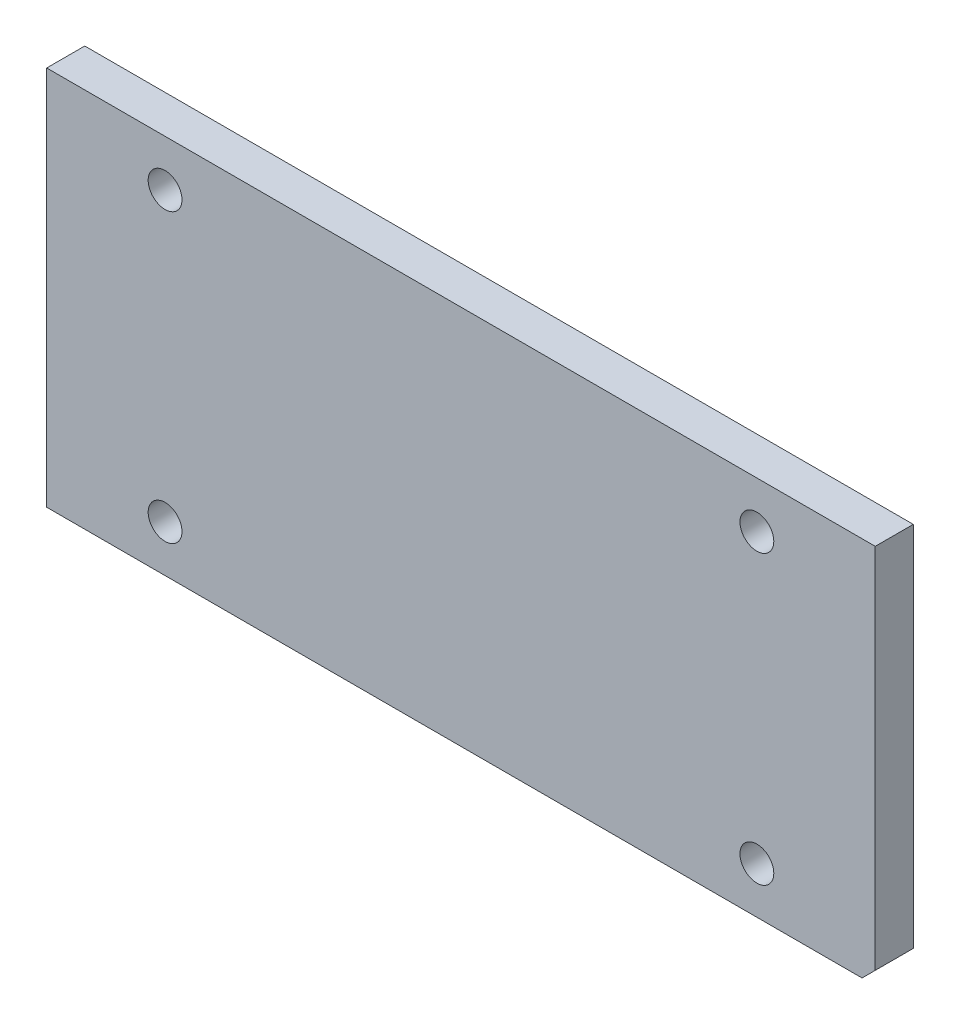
ISO-10303-21;
HEADER;
FILE_DESCRIPTION(('STEP AP214'),'2;1');
FILE_NAME('part.step','',(''),(''),'','','');
FILE_SCHEMA(('AUTOMOTIVE_DESIGN { 1 0 10303 214 1 1 1 1 }'));
ENDSEC;
DATA;
#1=APPLICATION_CONTEXT('core data for automotive mechanical design processes');
#2=APPLICATION_PROTOCOL_DEFINITION('international standard','automotive_design',2000,#1);
#3=PRODUCT_CONTEXT('',#1,'mechanical');
#4=PRODUCT('Part','Part','',(#3));
#5=PRODUCT_RELATED_PRODUCT_CATEGORY('part','',(#4));
#6=PRODUCT_DEFINITION_FORMATION('','',#4);
#7=PRODUCT_DEFINITION_CONTEXT('part definition',#1,'design');
#8=PRODUCT_DEFINITION('design','',#6,#7);
#9=PRODUCT_DEFINITION_SHAPE('','',#8);
#10=(LENGTH_UNIT() NAMED_UNIT(*) SI_UNIT(.MILLI.,.METRE.));
#11=(NAMED_UNIT(*) PLANE_ANGLE_UNIT() SI_UNIT($,.RADIAN.));
#12=(NAMED_UNIT(*) SI_UNIT($,.STERADIAN.) SOLID_ANGLE_UNIT());
#13=UNCERTAINTY_MEASURE_WITH_UNIT(LENGTH_MEASURE(1.E-05),#10,'distance_accuracy_value','');
#14=(GEOMETRIC_REPRESENTATION_CONTEXT(3) GLOBAL_UNCERTAINTY_ASSIGNED_CONTEXT((#13)) GLOBAL_UNIT_ASSIGNED_CONTEXT((#10,
#11,#12)) REPRESENTATION_CONTEXT('',''));
#15=CARTESIAN_POINT('',(0.,0.,0.));
#16=DIRECTION('',(0.,0.,1.));
#17=DIRECTION('',(1.,0.,0.));
#18=AXIS2_PLACEMENT_3D('',#15,#16,#17);
#19=CARTESIAN_POINT('',(-98.,-45.,-224.675682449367));
#20=DIRECTION('',(-1.,0.,0.));
#21=DIRECTION('',(0.,0.,1.));
#22=AXIS2_PLACEMENT_3D('',#19,#20,#21);
#23=PLANE('',#22);
#24=DIRECTION('',(0.,1.,0.));
#25=VECTOR('',#24,1.);
#26=CARTESIAN_POINT('',(-98.,-45.,-9.00000000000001));
#27=LINE('',#26,#25);
#28=CARTESIAN_POINT('',(-98.,-45.,-9.00000000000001));
#29=VERTEX_POINT('',#28);
#30=CARTESIAN_POINT('',(-98.,45.,-9.00000000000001));
#31=VERTEX_POINT('',#30);
#32=EDGE_CURVE('E87',#29,#31,#27,.T.);
#33=ORIENTED_EDGE('',*,*,#32,.F.);
#34=DIRECTION('',(0.,0.,1.));
#35=VECTOR('',#34,1.);
#36=CARTESIAN_POINT('',(-98.,-45.,-224.675682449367));
#37=LINE('',#36,#35);
#38=CARTESIAN_POINT('',(-98.,-45.,0.));
#39=VERTEX_POINT('',#38);
#40=EDGE_CURVE('E81',#29,#39,#37,.T.);
#41=ORIENTED_EDGE('',*,*,#40,.T.);
#42=DIRECTION('',(0.,-1.,0.));
#43=VECTOR('',#42,1.);
#44=CARTESIAN_POINT('',(-98.,-45.,0.));
#45=LINE('',#44,#43);
#46=CARTESIAN_POINT('',(-98.,45.,0.));
#47=VERTEX_POINT('',#46);
#48=EDGE_CURVE('E85',#47,#39,#45,.T.);
#49=ORIENTED_EDGE('',*,*,#48,.F.);
#50=DIRECTION('',(0.,0.,1.));
#51=VECTOR('',#50,1.);
#52=CARTESIAN_POINT('',(-98.,45.,-224.675682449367));
#53=LINE('',#52,#51);
#54=EDGE_CURVE('E112',#31,#47,#53,.T.);
#55=ORIENTED_EDGE('',*,*,#54,.F.);
#56=EDGE_LOOP('',(#33,#41,#49,#55));
#57=FACE_BOUND('',#56,.T.);
#58=ADVANCED_FACE('F34',(#57),#23,.T.);
#59=CARTESIAN_POINT('',(-98.,45.,-224.675682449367));
#60=DIRECTION('',(0.,1.,0.));
#61=DIRECTION('',(-1.,0.,0.));
#62=AXIS2_PLACEMENT_3D('',#59,#60,#61);
#63=PLANE('',#62);
#64=DIRECTION('',(1.,0.,0.));
#65=VECTOR('',#64,1.);
#66=CARTESIAN_POINT('',(-98.,45.,-9.00000000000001));
#67=LINE('',#66,#65);
#68=CARTESIAN_POINT('',(98.,45.,-9.00000000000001));
#69=VERTEX_POINT('',#68);
#70=EDGE_CURVE('E168',#31,#69,#67,.T.);
#71=ORIENTED_EDGE('',*,*,#70,.F.);
#72=ORIENTED_EDGE('',*,*,#54,.T.);
#73=DIRECTION('',(-1.,0.,0.));
#74=VECTOR('',#73,1.);
#75=CARTESIAN_POINT('',(-98.,45.,0.));
#76=LINE('',#75,#74);
#77=CARTESIAN_POINT('',(98.,45.,0.));
#78=VERTEX_POINT('',#77);
#79=EDGE_CURVE('E91',#78,#47,#76,.T.);
#80=ORIENTED_EDGE('',*,*,#79,.F.);
#81=DIRECTION('',(0.,0.,1.));
#82=VECTOR('',#81,1.);
#83=CARTESIAN_POINT('',(98.,45.,-224.675682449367));
#84=LINE('',#83,#82);
#85=EDGE_CURVE('E90',#69,#78,#84,.T.);
#86=ORIENTED_EDGE('',*,*,#85,.F.);
#87=EDGE_LOOP('',(#71,#72,#80,#86));
#88=FACE_BOUND('',#87,.T.);
#89=ADVANCED_FACE('F174',(#88),#63,.T.);
#90=CARTESIAN_POINT('',(98.,-45.,-224.675682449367));
#91=DIRECTION('',(1.,0.,0.));
#92=DIRECTION('',(0.,1.,0.));
#93=AXIS2_PLACEMENT_3D('',#90,#91,#92);
#94=PLANE('',#93);
#95=DIRECTION('',(0.,1.,0.));
#96=VECTOR('',#95,1.);
#97=CARTESIAN_POINT('',(98.,-45.,0.));
#98=LINE('',#97,#96);
#99=CARTESIAN_POINT('',(98.,-41.88,0.));
#100=VERTEX_POINT('',#99);
#101=EDGE_CURVE('E98',#100,#78,#98,.T.);
#102=ORIENTED_EDGE('',*,*,#101,.F.);
#103=DIRECTION('',(0.,0.,-1.));
#104=VECTOR('',#103,1.);
#105=CARTESIAN_POINT('',(98.,-41.88,-224.675682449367));
#106=LINE('',#105,#104);
#107=CARTESIAN_POINT('',(98.,-41.88,-9.00000000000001));
#108=VERTEX_POINT('',#107);
#109=EDGE_CURVE('E42',#100,#108,#106,.T.);
#110=ORIENTED_EDGE('',*,*,#109,.T.);
#111=DIRECTION('',(0.,-1.,0.));
#112=VECTOR('',#111,1.);
#113=CARTESIAN_POINT('',(98.,-45.,-9.00000000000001));
#114=LINE('',#113,#112);
#115=EDGE_CURVE('E114',#69,#108,#114,.T.);
#116=ORIENTED_EDGE('',*,*,#115,.F.);
#117=ORIENTED_EDGE('',*,*,#85,.T.);
#118=EDGE_LOOP('',(#102,#110,#116,#117));
#119=FACE_BOUND('',#118,.T.);
#120=ADVANCED_FACE('F175',(#119),#94,.T.);
#121=CARTESIAN_POINT('',(-98.,-45.,-224.675682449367));
#122=DIRECTION('',(0.,-1.,0.));
#123=DIRECTION('',(1.,0.,0.));
#124=AXIS2_PLACEMENT_3D('',#121,#122,#123);
#125=PLANE('',#124);
#126=DIRECTION('',(-1.,0.,0.));
#127=VECTOR('',#126,1.);
#128=CARTESIAN_POINT('',(-98.,-45.,-9.00000000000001));
#129=LINE('',#128,#127);
#130=CARTESIAN_POINT('',(94.88,-45.,-9.00000000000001));
#131=VERTEX_POINT('',#130);
#132=EDGE_CURVE('E117',#131,#29,#129,.T.);
#133=ORIENTED_EDGE('',*,*,#132,.F.);
#134=DIRECTION('',(0.,0.,1.));
#135=VECTOR('',#134,1.);
#136=CARTESIAN_POINT('',(94.88,-45.,-224.675682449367));
#137=LINE('',#136,#135);
#138=CARTESIAN_POINT('',(94.88,-45.,0.));
#139=VERTEX_POINT('',#138);
#140=EDGE_CURVE('E97',#131,#139,#137,.T.);
#141=ORIENTED_EDGE('',*,*,#140,.T.);
#142=DIRECTION('',(1.,0.,0.));
#143=VECTOR('',#142,1.);
#144=CARTESIAN_POINT('',(-98.,-45.,0.));
#145=LINE('',#144,#143);
#146=EDGE_CURVE('E94',#39,#139,#145,.T.);
#147=ORIENTED_EDGE('',*,*,#146,.F.);
#148=ORIENTED_EDGE('',*,*,#40,.F.);
#149=EDGE_LOOP('',(#133,#141,#147,#148));
#150=FACE_BOUND('',#149,.T.);
#151=ADVANCED_FACE('F95',(#150),#125,.T.);
#152=CARTESIAN_POINT('',(0.,0.,0.));
#153=DIRECTION('',(0.,0.,-1.));
#154=DIRECTION('',(-1.,0.,0.));
#155=AXIS2_PLACEMENT_3D('',#152,#153,#154);
#156=PLANE('',#155);
#157=CARTESIAN_POINT('',(70.0000000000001,-34.,0.));
#158=DIRECTION('',(0.,0.,1.));
#159=DIRECTION('',(1.,0.,0.));
#160=AXIS2_PLACEMENT_3D('',#157,#158,#159);
#161=CIRCLE('',#160,4.);
#162=CARTESIAN_POINT('',(74.0000000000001,-34.,0.));
#163=VERTEX_POINT('',#162);
#164=EDGE_CURVE('E146',#163,#163,#161,.T.);
#165=ORIENTED_EDGE('',*,*,#164,.F.);
#166=EDGE_LOOP('',(#165));
#167=FACE_BOUND('',#166,.T.);
#168=CARTESIAN_POINT('',(-70.,-34.,0.));
#169=DIRECTION('',(0.,0.,1.));
#170=DIRECTION('',(1.,0.,0.));
#171=AXIS2_PLACEMENT_3D('',#168,#169,#170);
#172=CIRCLE('',#171,4.);
#173=CARTESIAN_POINT('',(-65.9999999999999,-34.,0.));
#174=VERTEX_POINT('',#173);
#175=EDGE_CURVE('E132',#174,#174,#172,.T.);
#176=ORIENTED_EDGE('',*,*,#175,.F.);
#177=EDGE_LOOP('',(#176));
#178=FACE_BOUND('',#177,.T.);
#179=CARTESIAN_POINT('',(-70.,34.,0.));
#180=DIRECTION('',(0.,0.,1.));
#181=DIRECTION('',(1.,0.,0.));
#182=AXIS2_PLACEMENT_3D('',#179,#180,#181);
#183=CIRCLE('',#182,4.);
#184=CARTESIAN_POINT('',(-65.9999999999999,34.,0.));
#185=VERTEX_POINT('',#184);
#186=EDGE_CURVE('E127',#185,#185,#183,.T.);
#187=ORIENTED_EDGE('',*,*,#186,.F.);
#188=EDGE_LOOP('',(#187));
#189=FACE_BOUND('',#188,.T.);
#190=CARTESIAN_POINT('',(70.0000000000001,34.,0.));
#191=DIRECTION('',(0.,0.,1.));
#192=DIRECTION('',(1.,0.,0.));
#193=AXIS2_PLACEMENT_3D('',#190,#191,#192);
#194=CIRCLE('',#193,4.);
#195=CARTESIAN_POINT('',(74.0000000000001,34.,0.));
#196=VERTEX_POINT('',#195);
#197=EDGE_CURVE('E122',#196,#196,#194,.T.);
#198=ORIENTED_EDGE('',*,*,#197,.F.);
#199=EDGE_LOOP('',(#198));
#200=FACE_BOUND('',#199,.T.);
#201=ORIENTED_EDGE('',*,*,#146,.T.);
#202=DIRECTION('',(-0.707106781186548,-0.707106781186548,0.));
#203=VECTOR('',#202,1.);
#204=CARTESIAN_POINT('',(94.88,-45.,0.));
#205=LINE('',#204,#203);
#206=EDGE_CURVE('E56',#139,#100,#205,.F.);
#207=ORIENTED_EDGE('',*,*,#206,.T.);
#208=ORIENTED_EDGE('',*,*,#101,.T.);
#209=ORIENTED_EDGE('',*,*,#79,.T.);
#210=ORIENTED_EDGE('',*,*,#48,.T.);
#211=EDGE_LOOP('',(#201,#207,#208,#209,#210));
#212=FACE_BOUND('',#211,.T.);
#213=ADVANCED_FACE('F100',(#167,#178,#189,#200,#212),#156,.F.);
#214=CARTESIAN_POINT('',(0.,0.,-9.));
#215=DIRECTION('',(0.,0.,1.));
#216=DIRECTION('',(1.,0.,0.));
#217=AXIS2_PLACEMENT_3D('',#214,#215,#216);
#218=PLANE('',#217);
#219=CARTESIAN_POINT('',(70.0000000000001,-34.,-9.));
#220=DIRECTION('',(0.,0.,1.));
#221=DIRECTION('',(1.,0.,0.));
#222=AXIS2_PLACEMENT_3D('',#219,#220,#221);
#223=CIRCLE('',#222,3.4);
#224=CARTESIAN_POINT('',(73.4000000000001,-34.,-9.));
#225=VERTEX_POINT('',#224);
#226=EDGE_CURVE('E129',#225,#225,#223,.T.);
#227=ORIENTED_EDGE('',*,*,#226,.T.);
#228=EDGE_LOOP('',(#227));
#229=FACE_BOUND('',#228,.T.);
#230=CARTESIAN_POINT('',(-70.,-34.,-9.));
#231=DIRECTION('',(0.,0.,1.));
#232=DIRECTION('',(1.,0.,0.));
#233=AXIS2_PLACEMENT_3D('',#230,#231,#232);
#234=CIRCLE('',#233,3.4);
#235=CARTESIAN_POINT('',(-66.6,-34.,-9.));
#236=VERTEX_POINT('',#235);
#237=EDGE_CURVE('E124',#236,#236,#234,.T.);
#238=ORIENTED_EDGE('',*,*,#237,.T.);
#239=EDGE_LOOP('',(#238));
#240=FACE_BOUND('',#239,.T.);
#241=CARTESIAN_POINT('',(-70.,34.,-9.));
#242=DIRECTION('',(0.,0.,1.));
#243=DIRECTION('',(1.,0.,0.));
#244=AXIS2_PLACEMENT_3D('',#241,#242,#243);
#245=CIRCLE('',#244,3.4);
#246=CARTESIAN_POINT('',(-66.6,34.,-9.));
#247=VERTEX_POINT('',#246);
#248=EDGE_CURVE('E119',#247,#247,#245,.T.);
#249=ORIENTED_EDGE('',*,*,#248,.T.);
#250=EDGE_LOOP('',(#249));
#251=FACE_BOUND('',#250,.T.);
#252=CARTESIAN_POINT('',(70.0000000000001,34.,-9.));
#253=DIRECTION('',(0.,0.,1.));
#254=DIRECTION('',(1.,0.,0.));
#255=AXIS2_PLACEMENT_3D('',#252,#253,#254);
#256=CIRCLE('',#255,3.4);
#257=CARTESIAN_POINT('',(73.4000000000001,34.,-9.));
#258=VERTEX_POINT('',#257);
#259=EDGE_CURVE('E102',#258,#258,#256,.T.);
#260=ORIENTED_EDGE('',*,*,#259,.T.);
#261=EDGE_LOOP('',(#260));
#262=FACE_BOUND('',#261,.T.);
#263=ORIENTED_EDGE('',*,*,#115,.T.);
#264=DIRECTION('',(0.707106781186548,0.707106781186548,0.));
#265=VECTOR('',#264,1.);
#266=CARTESIAN_POINT('',(94.88,-45.,-9.00000000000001));
#267=LINE('',#266,#265);
#268=EDGE_CURVE('E11',#108,#131,#267,.F.);
#269=ORIENTED_EDGE('',*,*,#268,.T.);
#270=ORIENTED_EDGE('',*,*,#132,.T.);
#271=ORIENTED_EDGE('',*,*,#32,.T.);
#272=ORIENTED_EDGE('',*,*,#70,.T.);
#273=EDGE_LOOP('',(#263,#269,#270,#271,#272));
#274=FACE_BOUND('',#273,.T.);
#275=ADVANCED_FACE('F171',(#229,#240,#251,#262,#274),#218,.F.);
#276=CARTESIAN_POINT('',(70.0000000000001,34.,0.));
#277=DIRECTION('',(0.,0.,1.));
#278=DIRECTION('',(1.,0.,0.));
#279=AXIS2_PLACEMENT_3D('',#276,#277,#278);
#280=CYLINDRICAL_SURFACE('',#279,3.4);
#281=CARTESIAN_POINT('',(70.0000000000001,34.,-8.9));
#282=DIRECTION('',(0.,0.,1.));
#283=DIRECTION('',(1.,0.,0.));
#284=AXIS2_PLACEMENT_3D('',#281,#282,#283);
#285=CIRCLE('',#284,3.4);
#286=CARTESIAN_POINT('',(73.4000000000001,34.,-8.9));
#287=VERTEX_POINT('',#286);
#288=EDGE_CURVE('E105',#287,#287,#285,.T.);
#289=ORIENTED_EDGE('',*,*,#288,.T.);
#290=EDGE_LOOP('',(#289));
#291=FACE_BOUND('',#290,.T.);
#292=ORIENTED_EDGE('',*,*,#259,.F.);
#293=EDGE_LOOP('',(#292));
#294=FACE_BOUND('',#293,.T.);
#295=ADVANCED_FACE('F201',(#291,#294),#280,.F.);
#296=CARTESIAN_POINT('',(73.4000000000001,34.,-8.9));
#297=DIRECTION('',(0.,0.,-1.));
#298=DIRECTION('',(-1.,0.,0.));
#299=AXIS2_PLACEMENT_3D('',#296,#297,#298);
#300=PLANE('',#299);
#301=ORIENTED_EDGE('',*,*,#288,.F.);
#302=EDGE_LOOP('',(#301));
#303=FACE_BOUND('',#302,.T.);
#304=CARTESIAN_POINT('',(70.0000000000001,34.,-8.9));
#305=DIRECTION('',(0.,0.,1.));
#306=DIRECTION('',(1.,0.,0.));
#307=AXIS2_PLACEMENT_3D('',#304,#305,#306);
#308=CIRCLE('',#307,4.);
#309=CARTESIAN_POINT('',(74.0000000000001,34.,-8.9));
#310=VERTEX_POINT('',#309);
#311=EDGE_CURVE('E163',#310,#310,#308,.T.);
#312=ORIENTED_EDGE('',*,*,#311,.T.);
#313=EDGE_LOOP('',(#312));
#314=FACE_BOUND('',#313,.T.);
#315=ADVANCED_FACE('F204',(#303,#314),#300,.F.);
#316=CARTESIAN_POINT('',(70.0000000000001,34.,0.));
#317=DIRECTION('',(0.,0.,1.));
#318=DIRECTION('',(1.,0.,0.));
#319=AXIS2_PLACEMENT_3D('',#316,#317,#318);
#320=CYLINDRICAL_SURFACE('',#319,4.);
#321=ORIENTED_EDGE('',*,*,#311,.F.);
#322=EDGE_LOOP('',(#321));
#323=FACE_BOUND('',#322,.T.);
#324=ORIENTED_EDGE('',*,*,#197,.T.);
#325=EDGE_LOOP('',(#324));
#326=FACE_BOUND('',#325,.T.);
#327=ADVANCED_FACE('F208',(#323,#326),#320,.F.);
#328=CARTESIAN_POINT('',(-70.,34.,0.));
#329=DIRECTION('',(0.,0.,1.));
#330=DIRECTION('',(1.,0.,0.));
#331=AXIS2_PLACEMENT_3D('',#328,#329,#330);
#332=CYLINDRICAL_SURFACE('',#331,3.4);
#333=CARTESIAN_POINT('',(-70.,34.,-8.9));
#334=DIRECTION('',(0.,0.,1.));
#335=DIRECTION('',(1.,0.,0.));
#336=AXIS2_PLACEMENT_3D('',#333,#334,#335);
#337=CIRCLE('',#336,3.4);
#338=CARTESIAN_POINT('',(-66.6,34.,-8.9));
#339=VERTEX_POINT('',#338);
#340=EDGE_CURVE('E123',#339,#339,#337,.T.);
#341=ORIENTED_EDGE('',*,*,#340,.T.);
#342=EDGE_LOOP('',(#341));
#343=FACE_BOUND('',#342,.T.);
#344=ORIENTED_EDGE('',*,*,#248,.F.);
#345=EDGE_LOOP('',(#344));
#346=FACE_BOUND('',#345,.T.);
#347=ADVANCED_FACE('F212',(#343,#346),#332,.F.);
#348=CARTESIAN_POINT('',(-66.6,34.,-8.9));
#349=DIRECTION('',(0.,0.,-1.));
#350=DIRECTION('',(-1.,0.,0.));
#351=AXIS2_PLACEMENT_3D('',#348,#349,#350);
#352=PLANE('',#351);
#353=ORIENTED_EDGE('',*,*,#340,.F.);
#354=EDGE_LOOP('',(#353));
#355=FACE_BOUND('',#354,.T.);
#356=CARTESIAN_POINT('',(-70.,34.,-8.9));
#357=DIRECTION('',(0.,0.,1.));
#358=DIRECTION('',(1.,0.,0.));
#359=AXIS2_PLACEMENT_3D('',#356,#357,#358);
#360=CIRCLE('',#359,4.);
#361=CARTESIAN_POINT('',(-65.9999999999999,34.,-8.9));
#362=VERTEX_POINT('',#361);
#363=EDGE_CURVE('E156',#362,#362,#360,.T.);
#364=ORIENTED_EDGE('',*,*,#363,.T.);
#365=EDGE_LOOP('',(#364));
#366=FACE_BOUND('',#365,.T.);
#367=ADVANCED_FACE('F216',(#355,#366),#352,.F.);
#368=CARTESIAN_POINT('',(-70.,34.,0.));
#369=DIRECTION('',(0.,0.,1.));
#370=DIRECTION('',(1.,0.,0.));
#371=AXIS2_PLACEMENT_3D('',#368,#369,#370);
#372=CYLINDRICAL_SURFACE('',#371,4.);
#373=ORIENTED_EDGE('',*,*,#363,.F.);
#374=EDGE_LOOP('',(#373));
#375=FACE_BOUND('',#374,.T.);
#376=ORIENTED_EDGE('',*,*,#186,.T.);
#377=EDGE_LOOP('',(#376));
#378=FACE_BOUND('',#377,.T.);
#379=ADVANCED_FACE('F220',(#375,#378),#372,.F.);
#380=CARTESIAN_POINT('',(-70.,-34.,0.));
#381=DIRECTION('',(0.,0.,1.));
#382=DIRECTION('',(1.,0.,0.));
#383=AXIS2_PLACEMENT_3D('',#380,#381,#382);
#384=CYLINDRICAL_SURFACE('',#383,3.4);
#385=CARTESIAN_POINT('',(-70.,-34.,-8.9));
#386=DIRECTION('',(0.,0.,1.));
#387=DIRECTION('',(1.,0.,0.));
#388=AXIS2_PLACEMENT_3D('',#385,#386,#387);
#389=CIRCLE('',#388,3.4);
#390=CARTESIAN_POINT('',(-66.6,-34.,-8.9));
#391=VERTEX_POINT('',#390);
#392=EDGE_CURVE('E128',#391,#391,#389,.T.);
#393=ORIENTED_EDGE('',*,*,#392,.T.);
#394=EDGE_LOOP('',(#393));
#395=FACE_BOUND('',#394,.T.);
#396=ORIENTED_EDGE('',*,*,#237,.F.);
#397=EDGE_LOOP('',(#396));
#398=FACE_BOUND('',#397,.T.);
#399=ADVANCED_FACE('F224',(#395,#398),#384,.F.);
#400=CARTESIAN_POINT('',(-66.6,-34.,-8.9));
#401=DIRECTION('',(0.,0.,-1.));
#402=DIRECTION('',(-1.,0.,0.));
#403=AXIS2_PLACEMENT_3D('',#400,#401,#402);
#404=PLANE('',#403);
#405=ORIENTED_EDGE('',*,*,#392,.F.);
#406=EDGE_LOOP('',(#405));
#407=FACE_BOUND('',#406,.T.);
#408=CARTESIAN_POINT('',(-70.,-34.,-8.9));
#409=DIRECTION('',(0.,0.,1.));
#410=DIRECTION('',(1.,0.,0.));
#411=AXIS2_PLACEMENT_3D('',#408,#409,#410);
#412=CIRCLE('',#411,4.);
#413=CARTESIAN_POINT('',(-65.9999999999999,-34.,-8.9));
#414=VERTEX_POINT('',#413);
#415=EDGE_CURVE('E138',#414,#414,#412,.T.);
#416=ORIENTED_EDGE('',*,*,#415,.T.);
#417=EDGE_LOOP('',(#416));
#418=FACE_BOUND('',#417,.T.);
#419=ADVANCED_FACE('F228',(#407,#418),#404,.F.);
#420=CARTESIAN_POINT('',(-70.,-34.,0.));
#421=DIRECTION('',(0.,0.,1.));
#422=DIRECTION('',(1.,0.,0.));
#423=AXIS2_PLACEMENT_3D('',#420,#421,#422);
#424=CYLINDRICAL_SURFACE('',#423,4.);
#425=ORIENTED_EDGE('',*,*,#415,.F.);
#426=EDGE_LOOP('',(#425));
#427=FACE_BOUND('',#426,.T.);
#428=ORIENTED_EDGE('',*,*,#175,.T.);
#429=EDGE_LOOP('',(#428));
#430=FACE_BOUND('',#429,.T.);
#431=ADVANCED_FACE('F232',(#427,#430),#424,.F.);
#432=CARTESIAN_POINT('',(70.0000000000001,-34.,0.));
#433=DIRECTION('',(0.,0.,1.));
#434=DIRECTION('',(1.,0.,0.));
#435=AXIS2_PLACEMENT_3D('',#432,#433,#434);
#436=CYLINDRICAL_SURFACE('',#435,3.4);
#437=CARTESIAN_POINT('',(70.0000000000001,-34.,-8.9));
#438=DIRECTION('',(0.,0.,1.));
#439=DIRECTION('',(1.,0.,0.));
#440=AXIS2_PLACEMENT_3D('',#437,#438,#439);
#441=CIRCLE('',#440,3.4);
#442=CARTESIAN_POINT('',(73.4000000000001,-34.,-8.9));
#443=VERTEX_POINT('',#442);
#444=EDGE_CURVE('E133',#443,#443,#441,.T.);
#445=ORIENTED_EDGE('',*,*,#444,.T.);
#446=EDGE_LOOP('',(#445));
#447=FACE_BOUND('',#446,.T.);
#448=ORIENTED_EDGE('',*,*,#226,.F.);
#449=EDGE_LOOP('',(#448));
#450=FACE_BOUND('',#449,.T.);
#451=ADVANCED_FACE('F236',(#447,#450),#436,.F.);
#452=CARTESIAN_POINT('',(73.4000000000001,-34.,-8.9));
#453=DIRECTION('',(0.,0.,-1.));
#454=DIRECTION('',(-1.,0.,0.));
#455=AXIS2_PLACEMENT_3D('',#452,#453,#454);
#456=PLANE('',#455);
#457=ORIENTED_EDGE('',*,*,#444,.F.);
#458=EDGE_LOOP('',(#457));
#459=FACE_BOUND('',#458,.T.);
#460=CARTESIAN_POINT('',(70.0000000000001,-34.,-8.9));
#461=DIRECTION('',(0.,0.,1.));
#462=DIRECTION('',(1.,0.,0.));
#463=AXIS2_PLACEMENT_3D('',#460,#461,#462);
#464=CIRCLE('',#463,4.);
#465=CARTESIAN_POINT('',(74.0000000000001,-34.,-8.9));
#466=VERTEX_POINT('',#465);
#467=EDGE_CURVE('E141',#466,#466,#464,.T.);
#468=ORIENTED_EDGE('',*,*,#467,.T.);
#469=EDGE_LOOP('',(#468));
#470=FACE_BOUND('',#469,.T.);
#471=ADVANCED_FACE('F183',(#459,#470),#456,.F.);
#472=CARTESIAN_POINT('',(70.0000000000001,-34.,0.));
#473=DIRECTION('',(0.,0.,1.));
#474=DIRECTION('',(1.,0.,0.));
#475=AXIS2_PLACEMENT_3D('',#472,#473,#474);
#476=CYLINDRICAL_SURFACE('',#475,4.);
#477=ORIENTED_EDGE('',*,*,#467,.F.);
#478=EDGE_LOOP('',(#477));
#479=FACE_BOUND('',#478,.T.);
#480=ORIENTED_EDGE('',*,*,#164,.T.);
#481=EDGE_LOOP('',(#480));
#482=FACE_BOUND('',#481,.T.);
#483=ADVANCED_FACE('F179',(#479,#482),#476,.F.);
#484=CARTESIAN_POINT('',(94.88,-45.,-224.675682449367));
#485=DIRECTION('',(-0.707106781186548,0.707106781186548,0.));
#486=DIRECTION('',(0.,0.,1.));
#487=AXIS2_PLACEMENT_3D('',#484,#485,#486);
#488=PLANE('',#487);
#489=ORIENTED_EDGE('',*,*,#268,.F.);
#490=ORIENTED_EDGE('',*,*,#109,.F.);
#491=ORIENTED_EDGE('',*,*,#206,.F.);
#492=ORIENTED_EDGE('',*,*,#140,.F.);
#493=EDGE_LOOP('',(#489,#490,#491,#492));
#494=FACE_BOUND('',#493,.T.);
#495=ADVANCED_FACE('F36',(#494),#488,.F.);
#496=CLOSED_SHELL('',(#58,#89,#120,#151,#213,#275,#295,#315,#327,#347,#367,#379,#399,#419,#431,
#451,#471,#483,#495));
#497=MANIFOLD_SOLID_BREP('B2',#496);
#498=ADVANCED_BREP_SHAPE_REPRESENTATION('',(#18,#497),#14);
#499=SHAPE_DEFINITION_REPRESENTATION(#9,#498);
ENDSEC;
END-ISO-10303-21;
